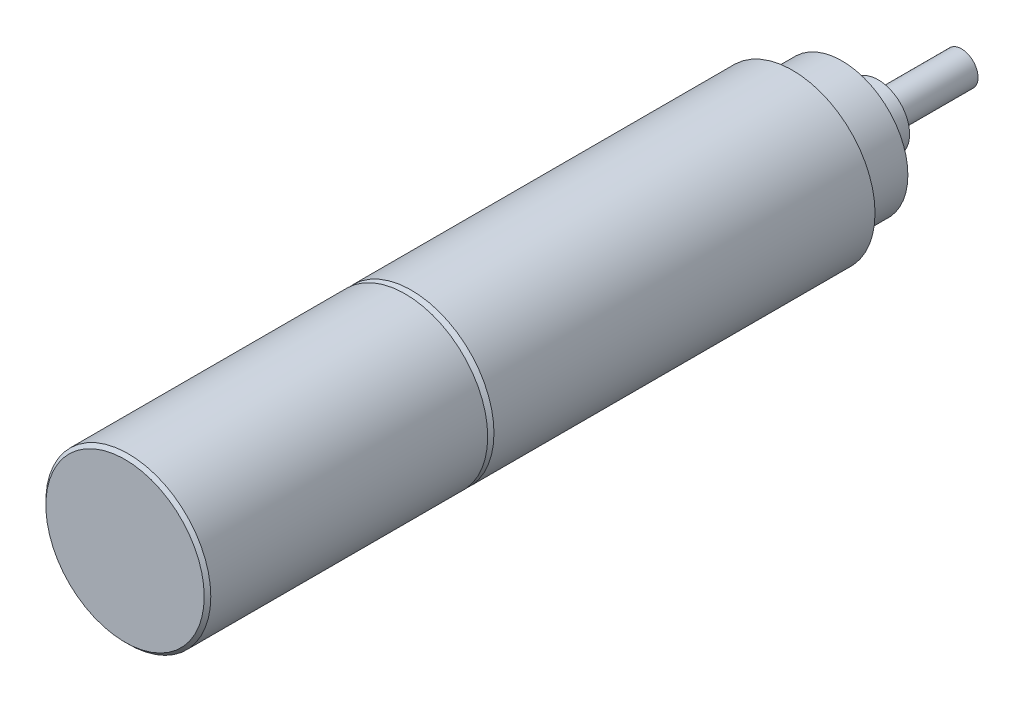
ISO-10303-21;
HEADER;
FILE_DESCRIPTION(('STEP AP214'),'2;1');
FILE_NAME('part.step','',(''),(''),'','','');
FILE_SCHEMA(('AUTOMOTIVE_DESIGN { 1 0 10303 214 1 1 1 1 }'));
ENDSEC;
DATA;
#1=APPLICATION_CONTEXT('core data for automotive mechanical design processes');
#2=APPLICATION_PROTOCOL_DEFINITION('international standard','automotive_design',2000,#1);
#3=PRODUCT_CONTEXT('',#1,'mechanical');
#4=PRODUCT('Part','Part','',(#3));
#5=PRODUCT_RELATED_PRODUCT_CATEGORY('part','',(#4));
#6=PRODUCT_DEFINITION_FORMATION('','',#4);
#7=PRODUCT_DEFINITION_CONTEXT('part definition',#1,'design');
#8=PRODUCT_DEFINITION('design','',#6,#7);
#9=PRODUCT_DEFINITION_SHAPE('','',#8);
#10=(LENGTH_UNIT() NAMED_UNIT(*) SI_UNIT(.MILLI.,.METRE.));
#11=(NAMED_UNIT(*) PLANE_ANGLE_UNIT() SI_UNIT($,.RADIAN.));
#12=(NAMED_UNIT(*) SI_UNIT($,.STERADIAN.) SOLID_ANGLE_UNIT());
#13=UNCERTAINTY_MEASURE_WITH_UNIT(LENGTH_MEASURE(1.E-05),#10,'distance_accuracy_value','');
#14=(GEOMETRIC_REPRESENTATION_CONTEXT(3) GLOBAL_UNCERTAINTY_ASSIGNED_CONTEXT((#13)) GLOBAL_UNIT_ASSIGNED_CONTEXT((#10,
#11,#12)) REPRESENTATION_CONTEXT('',''));
#15=CARTESIAN_POINT('',(0.,0.,0.));
#16=DIRECTION('',(0.,0.,1.));
#17=DIRECTION('',(1.,0.,0.));
#18=AXIS2_PLACEMENT_3D('',#15,#16,#17);
#19=CARTESIAN_POINT('',(0.,0.,-3.9972));
#20=DIRECTION('',(0.,0.,-1.));
#21=DIRECTION('',(-0.999999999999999,0.,0.));
#22=AXIS2_PLACEMENT_3D('',#19,#20,#21);
#23=PLANE('',#22);
#24=CARTESIAN_POINT('',(0.,0.,-3.9972));
#25=DIRECTION('',(0.,0.,-1.));
#26=DIRECTION('',(-0.999999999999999,0.,0.));
#27=AXIS2_PLACEMENT_3D('',#24,#25,#26);
#28=CIRCLE('',#27,2.5);
#29=CARTESIAN_POINT('',(-2.5,0.,-3.9972));
#30=VERTEX_POINT('',#29);
#31=EDGE_CURVE('E64',#30,#30,#28,.T.);
#32=ORIENTED_EDGE('',*,*,#31,.T.);
#33=EDGE_LOOP('',(#32));
#34=FACE_BOUND('',#33,.T.);
#35=CARTESIAN_POINT('',(0.,0.,-3.9972));
#36=DIRECTION('',(0.,0.,-1.));
#37=DIRECTION('',(-0.999999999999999,0.,0.));
#38=AXIS2_PLACEMENT_3D('',#35,#36,#37);
#39=CIRCLE('',#38,1.8);
#40=CARTESIAN_POINT('',(-1.8,0.,-3.9972));
#41=VERTEX_POINT('',#40);
#42=EDGE_CURVE('E73',#41,#41,#39,.T.);
#43=ORIENTED_EDGE('',*,*,#42,.F.);
#44=EDGE_LOOP('',(#43));
#45=FACE_BOUND('',#44,.T.);
#46=ADVANCED_FACE('F29',(#34,#45),#23,.T.);
#47=CARTESIAN_POINT('',(0.,0.,-2.9972));
#48=DIRECTION('',(0.,0.,-1.));
#49=DIRECTION('',(-0.999999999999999,0.,0.));
#50=AXIS2_PLACEMENT_3D('',#47,#48,#49);
#51=PLANE('',#50);
#52=CARTESIAN_POINT('',(0.,0.,-2.9972));
#53=DIRECTION('',(0.,0.,-1.));
#54=DIRECTION('',(-0.999999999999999,0.,0.));
#55=AXIS2_PLACEMENT_3D('',#52,#53,#54);
#56=CIRCLE('',#55,4.0005);
#57=CARTESIAN_POINT('',(4.0005,0.,-2.9972));
#58=VERTEX_POINT('',#57);
#59=EDGE_CURVE('E58',#58,#58,#56,.T.);
#60=ORIENTED_EDGE('',*,*,#59,.T.);
#61=EDGE_LOOP('',(#60));
#62=FACE_BOUND('',#61,.T.);
#63=CARTESIAN_POINT('',(0.,0.,-2.9972));
#64=DIRECTION('',(0.,0.,-1.));
#65=DIRECTION('',(-0.999999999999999,0.,0.));
#66=AXIS2_PLACEMENT_3D('',#63,#64,#65);
#67=CIRCLE('',#66,2.5);
#68=CARTESIAN_POINT('',(-2.5,0.,-2.9972));
#69=VERTEX_POINT('',#68);
#70=EDGE_CURVE('E65',#69,#69,#67,.T.);
#71=ORIENTED_EDGE('',*,*,#70,.F.);
#72=EDGE_LOOP('',(#71));
#73=FACE_BOUND('',#72,.T.);
#74=ADVANCED_FACE('F80',(#62,#73),#51,.T.);
#75=CARTESIAN_POINT('',(0.,0.,0.));
#76=DIRECTION('',(0.,0.,1.));
#77=DIRECTION('',(0.999999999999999,0.,0.));
#78=AXIS2_PLACEMENT_3D('',#75,#76,#77);
#79=PLANE('',#78);
#80=CARTESIAN_POINT('',(0.,0.,0.));
#81=DIRECTION('',(0.,0.,1.));
#82=DIRECTION('',(0.999999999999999,0.,0.));
#83=AXIS2_PLACEMENT_3D('',#80,#81,#82);
#84=CIRCLE('',#83,5.0038);
#85=CARTESIAN_POINT('',(5.0038,0.,0.));
#86=VERTEX_POINT('',#85);
#87=EDGE_CURVE('E52',#86,#86,#84,.T.);
#88=ORIENTED_EDGE('',*,*,#87,.F.);
#89=EDGE_LOOP('',(#88));
#90=FACE_BOUND('',#89,.T.);
#91=CARTESIAN_POINT('',(0.,0.,0.));
#92=DIRECTION('',(0.,0.,1.));
#93=DIRECTION('',(0.999999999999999,0.,0.));
#94=AXIS2_PLACEMENT_3D('',#91,#92,#93);
#95=CIRCLE('',#94,4.0005);
#96=CARTESIAN_POINT('',(4.0005,0.,0.));
#97=VERTEX_POINT('',#96);
#98=EDGE_CURVE('E41',#97,#97,#95,.F.);
#99=ORIENTED_EDGE('',*,*,#98,.F.);
#100=EDGE_LOOP('',(#99));
#101=FACE_BOUND('',#100,.T.);
#102=ADVANCED_FACE('F86',(#90,#101),#79,.F.);
#103=CARTESIAN_POINT('',(0.,0.,23.5));
#104=DIRECTION('',(0.,0.,-1.));
#105=DIRECTION('',(-0.999999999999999,0.,0.));
#106=AXIS2_PLACEMENT_3D('',#103,#104,#105);
#107=CYLINDRICAL_SURFACE('',#106,5.0038);
#108=CARTESIAN_POINT('',(0.,0.,23.119));
#109=DIRECTION('',(0.,0.,1.));
#110=DIRECTION('',(0.999999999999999,0.,0.));
#111=AXIS2_PLACEMENT_3D('',#108,#109,#110);
#112=CIRCLE('',#111,5.0038);
#113=CARTESIAN_POINT('',(5.0038,0.,23.119));
#114=VERTEX_POINT('',#113);
#115=EDGE_CURVE('E46',#114,#114,#112,.F.);
#116=ORIENTED_EDGE('',*,*,#115,.T.);
#117=EDGE_LOOP('',(#116));
#118=FACE_BOUND('',#117,.T.);
#119=ORIENTED_EDGE('',*,*,#87,.T.);
#120=EDGE_LOOP('',(#119));
#121=FACE_BOUND('',#120,.T.);
#122=ADVANCED_FACE('F123',(#118,#121),#107,.T.);
#123=CARTESIAN_POINT('',(0.,0.,23.5));
#124=DIRECTION('',(0.,0.,-1.));
#125=DIRECTION('',(-0.999999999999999,0.,0.));
#126=AXIS2_PLACEMENT_3D('',#123,#124,#125);
#127=CONICAL_SURFACE('',#126,4.6228,0.785398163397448);
#128=ORIENTED_EDGE('',*,*,#115,.F.);
#129=EDGE_LOOP('',(#128));
#130=FACE_BOUND('',#129,.T.);
#131=CARTESIAN_POINT('',(0.,0.,23.5));
#132=DIRECTION('',(0.,0.,1.));
#133=DIRECTION('',(0.999999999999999,0.,0.));
#134=AXIS2_PLACEMENT_3D('',#131,#132,#133);
#135=CIRCLE('',#134,4.6228);
#136=CARTESIAN_POINT('',(4.6228,0.,23.5));
#137=VERTEX_POINT('',#136);
#138=EDGE_CURVE('E49',#137,#137,#135,.T.);
#139=ORIENTED_EDGE('',*,*,#138,.F.);
#140=EDGE_LOOP('',(#139));
#141=FACE_BOUND('',#140,.T.);
#142=ADVANCED_FACE('F120',(#130,#141),#127,.T.);
#143=CARTESIAN_POINT('',(0.,0.,40.5));
#144=DIRECTION('',(0.,0.,-1.));
#145=DIRECTION('',(-0.999999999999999,0.,0.));
#146=AXIS2_PLACEMENT_3D('',#143,#144,#145);
#147=CYLINDRICAL_SURFACE('',#146,5.0038);
#148=CARTESIAN_POINT('',(0.,0.,40.3));
#149=DIRECTION('',(0.,0.,1.));
#150=DIRECTION('',(0.999999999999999,0.,0.));
#151=AXIS2_PLACEMENT_3D('',#148,#149,#150);
#152=CIRCLE('',#151,5.0038);
#153=CARTESIAN_POINT('',(5.0038,0.,40.3));
#154=VERTEX_POINT('',#153);
#155=EDGE_CURVE('E11',#154,#154,#152,.F.);
#156=ORIENTED_EDGE('',*,*,#155,.T.);
#157=EDGE_LOOP('',(#156));
#158=FACE_BOUND('',#157,.T.);
#159=CARTESIAN_POINT('',(0.,0.,23.5));
#160=DIRECTION('',(0.,0.,1.));
#161=DIRECTION('',(0.999999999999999,0.,0.));
#162=AXIS2_PLACEMENT_3D('',#159,#160,#161);
#163=CIRCLE('',#162,5.0038);
#164=CARTESIAN_POINT('',(5.0038,0.,23.5));
#165=VERTEX_POINT('',#164);
#166=EDGE_CURVE('E55',#165,#165,#163,.T.);
#167=ORIENTED_EDGE('',*,*,#166,.T.);
#168=EDGE_LOOP('',(#167));
#169=FACE_BOUND('',#168,.T.);
#170=ADVANCED_FACE('F113',(#158,#169),#147,.T.);
#171=CARTESIAN_POINT('',(0.,0.,40.5));
#172=DIRECTION('',(0.,0.,1.));
#173=DIRECTION('',(0.999999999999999,0.,0.));
#174=AXIS2_PLACEMENT_3D('',#171,#172,#173);
#175=PLANE('',#174);
#176=CARTESIAN_POINT('',(0.,0.,40.5));
#177=DIRECTION('',(0.,0.,1.));
#178=DIRECTION('',(0.999999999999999,0.,0.));
#179=AXIS2_PLACEMENT_3D('',#176,#177,#178);
#180=CIRCLE('',#179,4.8038);
#181=CARTESIAN_POINT('',(4.8038,0.,40.5));
#182=VERTEX_POINT('',#181);
#183=EDGE_CURVE('E37',#182,#182,#180,.T.);
#184=ORIENTED_EDGE('',*,*,#183,.T.);
#185=EDGE_LOOP('',(#184));
#186=FACE_BOUND('',#185,.T.);
#187=ADVANCED_FACE('F110',(#186),#175,.T.);
#188=CARTESIAN_POINT('',(0.,0.,23.5));
#189=DIRECTION('',(0.,0.,1.));
#190=DIRECTION('',(0.999999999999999,0.,0.));
#191=AXIS2_PLACEMENT_3D('',#188,#189,#190);
#192=PLANE('',#191);
#193=ORIENTED_EDGE('',*,*,#138,.T.);
#194=EDGE_LOOP('',(#193));
#195=FACE_BOUND('',#194,.T.);
#196=ORIENTED_EDGE('',*,*,#166,.F.);
#197=EDGE_LOOP('',(#196));
#198=FACE_BOUND('',#197,.T.);
#199=ADVANCED_FACE('F108',(#195,#198),#192,.F.);
#200=CARTESIAN_POINT('',(0.,0.,-2.9972));
#201=DIRECTION('',(0.,0.,1.));
#202=DIRECTION('',(0.999999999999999,0.,0.));
#203=AXIS2_PLACEMENT_3D('',#200,#201,#202);
#204=CYLINDRICAL_SURFACE('',#203,4.0005);
#205=CARTESIAN_POINT('',(4.0005,0.,-2.9972));
#206=CARTESIAN_POINT('',(4.0005,0.,-2.96597916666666));
#207=CARTESIAN_POINT('',(4.0005,0.,-2.93475833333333));
#208=CARTESIAN_POINT('',(4.0005,0.,-2.87231666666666));
#209=CARTESIAN_POINT('',(4.0005,0.,-2.84109583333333));
#210=CARTESIAN_POINT('',(4.0005,0.,-2.77865416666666));
#211=CARTESIAN_POINT('',(4.0005,0.,-2.74743333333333));
#212=CARTESIAN_POINT('',(4.0005,0.,-2.68499166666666));
#213=CARTESIAN_POINT('',(4.0005,0.,-2.65377083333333));
#214=CARTESIAN_POINT('',(4.0005,0.,-2.59132916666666));
#215=CARTESIAN_POINT('',(4.0005,0.,-2.56010833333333));
#216=CARTESIAN_POINT('',(4.0005,0.,-2.49766666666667));
#217=CARTESIAN_POINT('',(4.0005,0.,-2.46644583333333));
#218=CARTESIAN_POINT('',(4.0005,0.,-2.40400416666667));
#219=CARTESIAN_POINT('',(4.0005,0.,-2.37278333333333));
#220=CARTESIAN_POINT('',(4.0005,0.,-2.31034166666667));
#221=CARTESIAN_POINT('',(4.0005,0.,-2.27912083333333));
#222=CARTESIAN_POINT('',(4.0005,0.,-2.21667916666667));
#223=CARTESIAN_POINT('',(4.0005,0.,-2.18545833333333));
#224=CARTESIAN_POINT('',(4.0005,0.,-2.12301666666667));
#225=CARTESIAN_POINT('',(4.0005,0.,-2.09179583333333));
#226=CARTESIAN_POINT('',(4.0005,0.,-2.02935416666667));
#227=CARTESIAN_POINT('',(4.0005,0.,-1.99813333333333));
#228=CARTESIAN_POINT('',(4.0005,0.,-1.93569166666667));
#229=CARTESIAN_POINT('',(4.0005,0.,-1.90447083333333));
#230=CARTESIAN_POINT('',(4.0005,0.,-1.84202916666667));
#231=CARTESIAN_POINT('',(4.0005,0.,-1.81080833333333));
#232=CARTESIAN_POINT('',(4.0005,0.,-1.74836666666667));
#233=CARTESIAN_POINT('',(4.0005,0.,-1.71714583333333));
#234=CARTESIAN_POINT('',(4.0005,0.,-1.65470416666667));
#235=CARTESIAN_POINT('',(4.0005,0.,-1.62348333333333));
#236=CARTESIAN_POINT('',(4.0005,0.,-1.56104166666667));
#237=CARTESIAN_POINT('',(4.0005,0.,-1.52982083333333));
#238=CARTESIAN_POINT('',(4.0005,0.,-1.46737916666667));
#239=CARTESIAN_POINT('',(4.0005,0.,-1.43615833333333));
#240=CARTESIAN_POINT('',(4.0005,0.,-1.37371666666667));
#241=CARTESIAN_POINT('',(4.0005,0.,-1.34249583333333));
#242=CARTESIAN_POINT('',(4.0005,0.,-1.28005416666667));
#243=CARTESIAN_POINT('',(4.0005,0.,-1.24883333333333));
#244=CARTESIAN_POINT('',(4.0005,0.,-1.18639166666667));
#245=CARTESIAN_POINT('',(4.0005,0.,-1.15517083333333));
#246=CARTESIAN_POINT('',(4.0005,0.,-1.09272916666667));
#247=CARTESIAN_POINT('',(4.0005,0.,-1.06150833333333));
#248=CARTESIAN_POINT('',(4.0005,0.,-0.999066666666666));
#249=CARTESIAN_POINT('',(4.0005,0.,-0.967845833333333));
#250=CARTESIAN_POINT('',(4.0005,0.,-0.905404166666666));
#251=CARTESIAN_POINT('',(4.0005,0.,-0.874183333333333));
#252=CARTESIAN_POINT('',(4.0005,0.,-0.811741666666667));
#253=CARTESIAN_POINT('',(4.0005,0.,-0.780520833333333));
#254=CARTESIAN_POINT('',(4.0005,0.,-0.718079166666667));
#255=CARTESIAN_POINT('',(4.0005,0.,-0.686858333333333));
#256=CARTESIAN_POINT('',(4.0005,0.,-0.624416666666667));
#257=CARTESIAN_POINT('',(4.0005,0.,-0.593195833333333));
#258=CARTESIAN_POINT('',(4.0005,0.,-0.530754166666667));
#259=CARTESIAN_POINT('',(4.0005,0.,-0.499533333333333));
#260=CARTESIAN_POINT('',(4.0005,0.,-0.437091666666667));
#261=CARTESIAN_POINT('',(4.0005,0.,-0.405870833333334));
#262=CARTESIAN_POINT('',(4.0005,0.,-0.343429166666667));
#263=CARTESIAN_POINT('',(4.0005,0.,-0.312208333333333));
#264=CARTESIAN_POINT('',(4.0005,0.,-0.249766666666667));
#265=CARTESIAN_POINT('',(4.0005,0.,-0.218545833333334));
#266=CARTESIAN_POINT('',(4.0005,0.,-0.156104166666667));
#267=CARTESIAN_POINT('',(4.0005,0.,-0.124883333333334));
#268=CARTESIAN_POINT('',(4.0005,0.,-0.0624416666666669));
#269=CARTESIAN_POINT('',(4.0005,0.,-0.0312208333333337));
#270=CARTESIAN_POINT('',(4.0005,0.,0.));
#271=B_SPLINE_CURVE_WITH_KNOTS('',3,(#205,#206,#207,#208,#209,#210,#211,#212,#213,#214,#215,
#216,#217,#218,#219,#220,#221,#222,#223,#224,#225,#226,#227,#228,#229,#230,#231,#232,#233,#234,
#235,#236,#237,#238,#239,#240,#241,#242,#243,#244,#245,#246,#247,#248,#249,#250,#251,#252,#253,
#254,#255,#256,#257,#258,#259,#260,#261,#262,#263,#264,#265,#266,#267,#268,#269,#270),
.UNSPECIFIED.,.F.,.F.,(4,2,2,2,2,2,2,2,2,2,2,2,2,2,2,2,2,2,2,2,2,2,2,2,2,2,2,2,2,2,2,2,4),(0.,
0.0936624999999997,0.187324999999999,0.2809875,0.374649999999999,0.4683125,0.561974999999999,
0.655637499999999,0.749299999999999,0.842962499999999,0.936624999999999,1.0302875,1.12395,
1.2176125,1.311275,1.4049375,1.4986,1.5922625,1.685925,1.7795875,1.87325,1.9669125,2.060575,
2.1542375,2.2479,2.3415625,2.435225,2.5288875,2.62255,2.7162125,2.809875,2.9035375,2.9972),.UNSPECIFIED.);
#272=EDGE_CURVE('BSEAM105',#58,#97,#271,.T.);
#273=ORIENTED_EDGE('',*,*,#59,.F.);
#274=ORIENTED_EDGE('',*,*,#98,.T.);
#275=ORIENTED_EDGE('',*,*,#272,.T.);
#276=ORIENTED_EDGE('',*,*,#272,.F.);
#277=EDGE_LOOP('',(#273,#275,#274,#276));
#278=FACE_BOUND('',#277,.T.);
#279=ADVANCED_FACE('F105',(#278),#204,.T.);
#280=CARTESIAN_POINT('',(0.,0.,40.5));
#281=DIRECTION('',(0.,0.,-1.));
#282=DIRECTION('',(-0.999999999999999,0.,0.));
#283=AXIS2_PLACEMENT_3D('',#280,#281,#282);
#284=CONICAL_SURFACE('',#283,4.8038,0.785398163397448);
#285=ORIENTED_EDGE('',*,*,#155,.F.);
#286=EDGE_LOOP('',(#285));
#287=FACE_BOUND('',#286,.T.);
#288=ORIENTED_EDGE('',*,*,#183,.F.);
#289=EDGE_LOOP('',(#288));
#290=FACE_BOUND('',#289,.T.);
#291=ADVANCED_FACE('F31',(#287,#290),#284,.T.);
#292=CARTESIAN_POINT('',(0.,0.,-3.9972));
#293=DIRECTION('',(0.,0.,1.));
#294=DIRECTION('',(0.999999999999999,0.,0.));
#295=AXIS2_PLACEMENT_3D('',#292,#293,#294);
#296=CYLINDRICAL_SURFACE('',#295,2.5);
#297=ORIENTED_EDGE('',*,*,#31,.F.);
#298=EDGE_LOOP('',(#297));
#299=FACE_BOUND('',#298,.T.);
#300=ORIENTED_EDGE('',*,*,#70,.T.);
#301=EDGE_LOOP('',(#300));
#302=FACE_BOUND('',#301,.T.);
#303=ADVANCED_FACE('F92',(#299,#302),#296,.T.);
#304=CARTESIAN_POINT('',(0.,0.,-5.1972));
#305=DIRECTION('',(0.,0.,-1.));
#306=DIRECTION('',(-0.999999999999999,0.,0.));
#307=AXIS2_PLACEMENT_3D('',#304,#305,#306);
#308=PLANE('',#307);
#309=CARTESIAN_POINT('',(0.,0.,-5.1972));
#310=DIRECTION('',(0.,0.,-1.));
#311=DIRECTION('',(-0.999999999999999,0.,0.));
#312=AXIS2_PLACEMENT_3D('',#309,#310,#311);
#313=CIRCLE('',#312,1.90498639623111);
#314=CARTESIAN_POINT('',(-1.90498639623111,0.,-5.1972));
#315=VERTEX_POINT('',#314);
#316=EDGE_CURVE('E70',#315,#315,#313,.T.);
#317=ORIENTED_EDGE('',*,*,#316,.T.);
#318=EDGE_LOOP('',(#317));
#319=FACE_BOUND('',#318,.T.);
#320=CARTESIAN_POINT('',(0.,0.,-5.1972));
#321=DIRECTION('',(0.,0.,-1.));
#322=DIRECTION('',(-0.999999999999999,0.,0.));
#323=AXIS2_PLACEMENT_3D('',#320,#321,#322);
#324=CIRCLE('',#323,1.0033);
#325=CARTESIAN_POINT('',(-1.0033,0.,-5.1972));
#326=VERTEX_POINT('',#325);
#327=EDGE_CURVE('E33',#326,#326,#324,.T.);
#328=ORIENTED_EDGE('',*,*,#327,.F.);
#329=EDGE_LOOP('',(#328));
#330=FACE_BOUND('',#329,.T.);
#331=ADVANCED_FACE('F95',(#319,#330),#308,.T.);
#332=CARTESIAN_POINT('',(0.,0.,-3.9972));
#333=DIRECTION('',(0.,0.,-1.));
#334=DIRECTION('',(-0.999999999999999,0.,0.));
#335=AXIS2_PLACEMENT_3D('',#332,#333,#334);
#336=CONICAL_SURFACE('',#335,1.8,0.0872664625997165);
#337=ORIENTED_EDGE('',*,*,#316,.F.);
#338=EDGE_LOOP('',(#337));
#339=FACE_BOUND('',#338,.T.);
#340=ORIENTED_EDGE('',*,*,#42,.T.);
#341=EDGE_LOOP('',(#340));
#342=FACE_BOUND('',#341,.T.);
#343=ADVANCED_FACE('F77',(#339,#342),#336,.T.);
#344=CARTESIAN_POINT('',(0.,0.,-10.25));
#345=DIRECTION('',(0.,0.,-1.));
#346=DIRECTION('',(-0.999999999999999,0.,0.));
#347=AXIS2_PLACEMENT_3D('',#344,#345,#346);
#348=PLANE('',#347);
#349=CARTESIAN_POINT('',(0.,0.,-10.25));
#350=DIRECTION('',(0.,0.,-1.));
#351=DIRECTION('',(-0.999999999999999,0.,0.));
#352=AXIS2_PLACEMENT_3D('',#349,#350,#351);
#353=CIRCLE('',#352,1.0033);
#354=CARTESIAN_POINT('',(-1.0033,0.,-10.25));
#355=VERTEX_POINT('',#354);
#356=EDGE_CURVE('E61',#355,#355,#353,.T.);
#357=ORIENTED_EDGE('',*,*,#356,.T.);
#358=EDGE_LOOP('',(#357));
#359=FACE_BOUND('',#358,.T.);
#360=ADVANCED_FACE('F97',(#359),#348,.T.);
#361=CARTESIAN_POINT('',(0.,0.,-10.25));
#362=DIRECTION('',(0.,0.,1.));
#363=DIRECTION('',(0.999999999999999,0.,0.));
#364=AXIS2_PLACEMENT_3D('',#361,#362,#363);
#365=CYLINDRICAL_SURFACE('',#364,1.0033);
#366=ORIENTED_EDGE('',*,*,#327,.T.);
#367=EDGE_LOOP('',(#366));
#368=FACE_BOUND('',#367,.T.);
#369=ORIENTED_EDGE('',*,*,#356,.F.);
#370=EDGE_LOOP('',(#369));
#371=FACE_BOUND('',#370,.T.);
#372=ADVANCED_FACE('F100',(#368,#371),#365,.T.);
#373=CLOSED_SHELL('',(#46,#74,#102,#122,#142,#170,#187,#199,#279,#291,#303,#331,#343,#360,#372));
#374=MANIFOLD_SOLID_BREP('B2',#373);
#375=ADVANCED_BREP_SHAPE_REPRESENTATION('',(#18,#374),#14);
#376=SHAPE_DEFINITION_REPRESENTATION(#9,#375);
ENDSEC;
END-ISO-10303-21;
